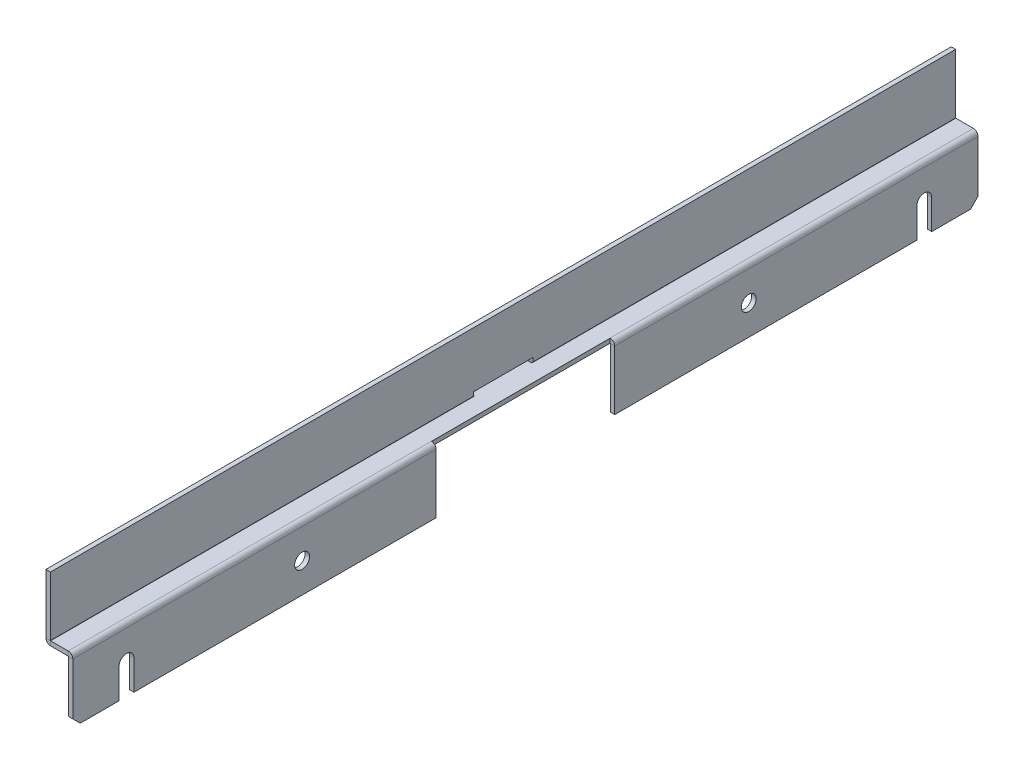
ISO-10303-21;
HEADER;
FILE_DESCRIPTION(('STEP AP214'),'2;1');
FILE_NAME('part.step','',(''),(''),'','','');
FILE_SCHEMA(('AUTOMOTIVE_DESIGN { 1 0 10303 214 1 1 1 1 }'));
ENDSEC;
DATA;
#1=APPLICATION_CONTEXT('core data for automotive mechanical design processes');
#2=APPLICATION_PROTOCOL_DEFINITION('international standard','automotive_design',2000,#1);
#3=PRODUCT_CONTEXT('',#1,'mechanical');
#4=PRODUCT('Part','Part','',(#3));
#5=PRODUCT_RELATED_PRODUCT_CATEGORY('part','',(#4));
#6=PRODUCT_DEFINITION_FORMATION('','',#4);
#7=PRODUCT_DEFINITION_CONTEXT('part definition',#1,'design');
#8=PRODUCT_DEFINITION('design','',#6,#7);
#9=PRODUCT_DEFINITION_SHAPE('','',#8);
#10=(LENGTH_UNIT() NAMED_UNIT(*) SI_UNIT(.MILLI.,.METRE.));
#11=(NAMED_UNIT(*) PLANE_ANGLE_UNIT() SI_UNIT($,.RADIAN.));
#12=(NAMED_UNIT(*) SI_UNIT($,.STERADIAN.) SOLID_ANGLE_UNIT());
#13=UNCERTAINTY_MEASURE_WITH_UNIT(LENGTH_MEASURE(1.E-05),#10,'distance_accuracy_value','');
#14=(GEOMETRIC_REPRESENTATION_CONTEXT(3) GLOBAL_UNCERTAINTY_ASSIGNED_CONTEXT((#13)) GLOBAL_UNIT_ASSIGNED_CONTEXT((#10,
#11,#12)) REPRESENTATION_CONTEXT('',''));
#15=CARTESIAN_POINT('',(0.,0.,0.));
#16=DIRECTION('',(0.,0.,1.));
#17=DIRECTION('',(1.,0.,0.));
#18=AXIS2_PLACEMENT_3D('',#15,#16,#17);
#19=CARTESIAN_POINT('',(0.10000000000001,-43.001,20.));
#20=DIRECTION('',(1.,0.,0.));
#21=DIRECTION('',(0.,0.,-1.));
#22=AXIS2_PLACEMENT_3D('',#19,#20,#21);
#23=PLANE('',#22);
#24=DIRECTION('',(0.,0.,1.));
#25=VECTOR('',#24,1.);
#26=CARTESIAN_POINT('',(0.10000000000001,-43.,20.));
#27=LINE('',#26,#25);
#28=CARTESIAN_POINT('',(0.10000000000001,-43.,-20.));
#29=VERTEX_POINT('',#28);
#30=CARTESIAN_POINT('',(0.100000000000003,-43.,-19.2));
#31=VERTEX_POINT('',#30);
#32=EDGE_CURVE('E606',#29,#31,#27,.T.);
#33=ORIENTED_EDGE('',*,*,#32,.T.);
#34=DIRECTION('',(0.,-1.,0.));
#35=VECTOR('',#34,1.);
#36=CARTESIAN_POINT('',(0.100000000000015,-40.,-19.2));
#37=LINE('',#36,#35);
#38=CARTESIAN_POINT('',(0.100000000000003,-40.,-19.2));
#39=VERTEX_POINT('',#38);
#40=EDGE_CURVE('E72',#39,#31,#37,.T.);
#41=ORIENTED_EDGE('',*,*,#40,.F.);
#42=DIRECTION('',(0.,0.,-1.));
#43=VECTOR('',#42,1.);
#44=CARTESIAN_POINT('',(0.10000000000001,-40.,20.));
#45=LINE('',#44,#43);
#46=CARTESIAN_POINT('',(0.100000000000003,-40.,-20.));
#47=VERTEX_POINT('',#46);
#48=EDGE_CURVE('E603',#39,#47,#45,.T.);
#49=ORIENTED_EDGE('',*,*,#48,.T.);
#50=DIRECTION('',(0.,1.,0.));
#51=VECTOR('',#50,1.);
#52=CARTESIAN_POINT('',(0.100000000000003,-43.001,-20.));
#53=LINE('',#52,#51);
#54=EDGE_CURVE('E13',#29,#47,#53,.T.);
#55=ORIENTED_EDGE('',*,*,#54,.F.);
#56=EDGE_LOOP('',(#33,#41,#49,#55));
#57=FACE_BOUND('',#56,.T.);
#58=ADVANCED_FACE('F57',(#57),#23,.F.);
#59=CARTESIAN_POINT('',(11.9,-43.1,-304.));
#60=DIRECTION('',(0.,0.,1.));
#61=DIRECTION('',(1.,0.,0.));
#62=AXIS2_PLACEMENT_3D('',#59,#60,#61);
#63=PLANE('',#62);
#64=DIRECTION('',(0.,1.,0.));
#65=VECTOR('',#64,1.);
#66=CARTESIAN_POINT('',(11.9,-43.,-304.));
#67=LINE('',#66,#65);
#68=CARTESIAN_POINT('',(11.9,-43.,-304.));
#69=VERTEX_POINT('',#68);
#70=CARTESIAN_POINT('',(11.9,-40.,-304.));
#71=VERTEX_POINT('',#70);
#72=EDGE_CURVE('E625',#69,#71,#67,.T.);
#73=ORIENTED_EDGE('',*,*,#72,.F.);
#74=DIRECTION('',(1.,0.,0.));
#75=VECTOR('',#74,1.);
#76=CARTESIAN_POINT('',(0.,-43.,-304.));
#77=LINE('',#76,#75);
#78=CARTESIAN_POINT('',(0.10000000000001,-43.,-304.));
#79=VERTEX_POINT('',#78);
#80=EDGE_CURVE('E612',#79,#69,#77,.T.);
#81=ORIENTED_EDGE('',*,*,#80,.F.);
#82=DIRECTION('',(0.,-1.,0.));
#83=VECTOR('',#82,1.);
#84=CARTESIAN_POINT('',(0.10000000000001,-40.,-304.));
#85=LINE('',#84,#83);
#86=CARTESIAN_POINT('',(0.100000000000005,-40.,-304.));
#87=VERTEX_POINT('',#86);
#88=EDGE_CURVE('E642',#87,#79,#85,.T.);
#89=ORIENTED_EDGE('',*,*,#88,.F.);
#90=DIRECTION('',(1.,0.,0.));
#91=VECTOR('',#90,1.);
#92=CARTESIAN_POINT('',(0.,-40.,-304.));
#93=LINE('',#92,#91);
#94=EDGE_CURVE('E608',#87,#71,#93,.T.);
#95=ORIENTED_EDGE('',*,*,#94,.T.);
#96=EDGE_LOOP('',(#73,#81,#89,#95));
#97=FACE_BOUND('',#96,.T.);
#98=ADVANCED_FACE('F730',(#97),#63,.F.);
#99=CARTESIAN_POINT('',(11.9,-43.1,304.));
#100=DIRECTION('',(0.,0.,1.));
#101=DIRECTION('',(1.,0.,0.));
#102=AXIS2_PLACEMENT_3D('',#99,#100,#101);
#103=PLANE('',#102);
#104=DIRECTION('',(0.,-1.,0.));
#105=VECTOR('',#104,1.);
#106=CARTESIAN_POINT('',(11.9,-40.,304.));
#107=LINE('',#106,#105);
#108=CARTESIAN_POINT('',(11.9,-40.,304.));
#109=VERTEX_POINT('',#108);
#110=CARTESIAN_POINT('',(11.9,-43.,304.));
#111=VERTEX_POINT('',#110);
#112=EDGE_CURVE('E619',#109,#111,#107,.T.);
#113=ORIENTED_EDGE('',*,*,#112,.F.);
#114=DIRECTION('',(1.,0.,0.));
#115=VECTOR('',#114,1.);
#116=CARTESIAN_POINT('',(0.,-40.,304.));
#117=LINE('',#116,#115);
#118=CARTESIAN_POINT('',(0.100000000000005,-40.,304.));
#119=VERTEX_POINT('',#118);
#120=EDGE_CURVE('E609',#119,#109,#117,.T.);
#121=ORIENTED_EDGE('',*,*,#120,.F.);
#122=DIRECTION('',(0.,1.,0.));
#123=VECTOR('',#122,1.);
#124=CARTESIAN_POINT('',(0.10000000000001,-43.,304.));
#125=LINE('',#124,#123);
#126=CARTESIAN_POINT('',(0.10000000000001,-43.,304.));
#127=VERTEX_POINT('',#126);
#128=EDGE_CURVE('E636',#127,#119,#125,.T.);
#129=ORIENTED_EDGE('',*,*,#128,.F.);
#130=DIRECTION('',(1.,0.,0.));
#131=VECTOR('',#130,1.);
#132=CARTESIAN_POINT('',(0.,-43.,304.));
#133=LINE('',#132,#131);
#134=EDGE_CURVE('E611',#127,#111,#133,.T.);
#135=ORIENTED_EDGE('',*,*,#134,.T.);
#136=EDGE_LOOP('',(#113,#121,#129,#135));
#137=FACE_BOUND('',#136,.T.);
#138=ADVANCED_FACE('F59',(#137),#103,.T.);
#139=CARTESIAN_POINT('',(0.,-40.,304.));
#140=DIRECTION('',(0.,1.,0.));
#141=DIRECTION('',(0.,0.,1.));
#142=AXIS2_PLACEMENT_3D('',#139,#140,#141);
#143=PLANE('',#142);
#144=ORIENTED_EDGE('',*,*,#94,.F.);
#145=DIRECTION('',(0.,0.,-1.));
#146=VECTOR('',#145,1.);
#147=CARTESIAN_POINT('',(0.10000000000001,-40.,304.));
#148=LINE('',#147,#146);
#149=EDGE_CURVE('E639',#47,#87,#148,.T.);
#150=ORIENTED_EDGE('',*,*,#149,.F.);
#151=ORIENTED_EDGE('',*,*,#48,.F.);
#152=DIRECTION('',(1.,0.,0.));
#153=VECTOR('',#152,1.);
#154=CARTESIAN_POINT('',(0.100000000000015,-40.,-19.2));
#155=LINE('',#154,#153);
#156=CARTESIAN_POINT('',(-2.89999999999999,-40.,-19.2));
#157=VERTEX_POINT('',#156);
#158=EDGE_CURVE('E323',#157,#39,#155,.T.);
#159=ORIENTED_EDGE('',*,*,#158,.F.);
#160=DIRECTION('',(0.,0.,-1.));
#161=VECTOR('',#160,1.);
#162=CARTESIAN_POINT('',(-2.89999999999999,-40.,19.2));
#163=LINE('',#162,#161);
#164=CARTESIAN_POINT('',(-2.89999999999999,-40.,19.2));
#165=VERTEX_POINT('',#164);
#166=EDGE_CURVE('E306',#165,#157,#163,.T.);
#167=ORIENTED_EDGE('',*,*,#166,.F.);
#168=DIRECTION('',(-1.,0.,0.));
#169=VECTOR('',#168,1.);
#170=CARTESIAN_POINT('',(0.10000000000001,-40.,19.2));
#171=LINE('',#170,#169);
#172=CARTESIAN_POINT('',(0.10000000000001,-40.,19.2));
#173=VERTEX_POINT('',#172);
#174=EDGE_CURVE('E321',#173,#165,#171,.T.);
#175=ORIENTED_EDGE('',*,*,#174,.F.);
#176=CARTESIAN_POINT('',(0.10000000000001,-40.,20.));
#177=VERTEX_POINT('',#176);
#178=EDGE_CURVE('E80',#177,#173,#45,.T.);
#179=ORIENTED_EDGE('',*,*,#178,.F.);
#180=DIRECTION('',(0.,0.,-1.));
#181=VECTOR('',#180,1.);
#182=CARTESIAN_POINT('',(0.10000000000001,-40.,304.));
#183=LINE('',#182,#181);
#184=EDGE_CURVE('E628',#119,#177,#183,.T.);
#185=ORIENTED_EDGE('',*,*,#184,.F.);
#186=ORIENTED_EDGE('',*,*,#120,.T.);
#187=DIRECTION('',(0.,0.,-1.));
#188=VECTOR('',#187,1.);
#189=CARTESIAN_POINT('',(11.9,-40.,304.));
#190=LINE('',#189,#188);
#191=EDGE_CURVE('E614',#109,#71,#190,.T.);
#192=ORIENTED_EDGE('',*,*,#191,.T.);
#193=EDGE_LOOP('',(#144,#150,#151,#159,#167,#175,#179,#185,#186,#192));
#194=FACE_BOUND('',#193,.T.);
#195=ADVANCED_FACE('F320',(#194),#143,.T.);
#196=CARTESIAN_POINT('',(0.,-43.,304.));
#197=DIRECTION('',(0.,1.,0.));
#198=DIRECTION('',(0.,0.,1.));
#199=AXIS2_PLACEMENT_3D('',#196,#197,#198);
#200=PLANE('',#199);
#201=ORIENTED_EDGE('',*,*,#80,.T.);
#202=DIRECTION('',(0.,0.,-1.));
#203=VECTOR('',#202,1.);
#204=CARTESIAN_POINT('',(11.9,-43.,304.));
#205=LINE('',#204,#203);
#206=EDGE_CURVE('E622',#111,#69,#205,.T.);
#207=ORIENTED_EDGE('',*,*,#206,.F.);
#208=ORIENTED_EDGE('',*,*,#134,.F.);
#209=DIRECTION('',(0.,0.,-1.));
#210=VECTOR('',#209,1.);
#211=CARTESIAN_POINT('',(0.10000000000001,-43.,304.));
#212=LINE('',#211,#210);
#213=CARTESIAN_POINT('',(0.10000000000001,-43.,20.));
#214=VERTEX_POINT('',#213);
#215=EDGE_CURVE('E633',#127,#214,#212,.T.);
#216=ORIENTED_EDGE('',*,*,#215,.T.);
#217=CARTESIAN_POINT('',(0.10000000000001,-43.,19.2));
#218=VERTEX_POINT('',#217);
#219=EDGE_CURVE('E605',#218,#214,#27,.T.);
#220=ORIENTED_EDGE('',*,*,#219,.F.);
#221=DIRECTION('',(-1.,0.,0.));
#222=VECTOR('',#221,1.);
#223=CARTESIAN_POINT('',(0.10000000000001,-43.,19.2));
#224=LINE('',#223,#222);
#225=CARTESIAN_POINT('',(-2.89999999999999,-43.,19.2));
#226=VERTEX_POINT('',#225);
#227=EDGE_CURVE('E332',#218,#226,#224,.T.);
#228=ORIENTED_EDGE('',*,*,#227,.T.);
#229=DIRECTION('',(0.,0.,-1.));
#230=VECTOR('',#229,1.);
#231=CARTESIAN_POINT('',(-2.89999999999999,-43.,19.2));
#232=LINE('',#231,#230);
#233=CARTESIAN_POINT('',(-2.89999999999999,-43.,-19.2));
#234=VERTEX_POINT('',#233);
#235=EDGE_CURVE('E309',#226,#234,#232,.T.);
#236=ORIENTED_EDGE('',*,*,#235,.T.);
#237=DIRECTION('',(1.,0.,0.));
#238=VECTOR('',#237,1.);
#239=CARTESIAN_POINT('',(0.100000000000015,-43.,-19.2));
#240=LINE('',#239,#238);
#241=EDGE_CURVE('E326',#234,#31,#240,.T.);
#242=ORIENTED_EDGE('',*,*,#241,.T.);
#243=ORIENTED_EDGE('',*,*,#32,.F.);
#244=DIRECTION('',(0.,0.,-1.));
#245=VECTOR('',#244,1.);
#246=CARTESIAN_POINT('',(0.10000000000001,-43.,304.));
#247=LINE('',#246,#245);
#248=EDGE_CURVE('E65',#29,#79,#247,.T.);
#249=ORIENTED_EDGE('',*,*,#248,.T.);
#250=EDGE_LOOP('',(#201,#207,#208,#216,#220,#228,#236,#242,#243,#249));
#251=FACE_BOUND('',#250,.T.);
#252=ADVANCED_FACE('F647',(#251),#200,.F.);
#253=ORIENTED_EDGE('',*,*,#178,.T.);
#254=DIRECTION('',(0.,-1.,0.));
#255=VECTOR('',#254,1.);
#256=CARTESIAN_POINT('',(0.10000000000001,-40.,19.2));
#257=LINE('',#256,#255);
#258=EDGE_CURVE('E315',#173,#218,#257,.T.);
#259=ORIENTED_EDGE('',*,*,#258,.T.);
#260=ORIENTED_EDGE('',*,*,#219,.T.);
#261=DIRECTION('',(0.,1.,0.));
#262=VECTOR('',#261,1.);
#263=CARTESIAN_POINT('',(0.10000000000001,-43.001,20.));
#264=LINE('',#263,#262);
#265=EDGE_CURVE('E631',#214,#177,#264,.T.);
#266=ORIENTED_EDGE('',*,*,#265,.T.);
#267=EDGE_LOOP('',(#253,#259,#260,#266));
#268=FACE_BOUND('',#267,.T.);
#269=ADVANCED_FACE('F691',(#268),#23,.F.);
#270=CARTESIAN_POINT('',(11.9,-43.1,304.));
#271=DIRECTION('',(0.,0.,1.));
#272=DIRECTION('',(0.,1.,0.));
#273=AXIS2_PLACEMENT_3D('',#270,#271,#272);
#274=PLANE('',#273);
#275=ORIENTED_EDGE('',*,*,#112,.T.);
#276=CARTESIAN_POINT('',(11.9,-43.1,304.));
#277=DIRECTION('',(0.,0.,-1.));
#278=DIRECTION('',(0.,-1.,0.));
#279=AXIS2_PLACEMENT_3D('',#276,#277,#278);
#280=CIRCLE('',#279,0.0999999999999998);
#281=CARTESIAN_POINT('',(12.,-43.1,304.));
#282=VERTEX_POINT('',#281);
#283=EDGE_CURVE('E500',#111,#282,#280,.T.);
#284=ORIENTED_EDGE('',*,*,#283,.T.);
#285=DIRECTION('',(1.,0.,0.));
#286=VECTOR('',#285,1.);
#287=CARTESIAN_POINT('',(12.,-43.1,304.));
#288=LINE('',#287,#286);
#289=CARTESIAN_POINT('',(15.,-43.1,304.));
#290=VERTEX_POINT('',#289);
#291=EDGE_CURVE('E562',#282,#290,#288,.T.);
#292=ORIENTED_EDGE('',*,*,#291,.T.);
#293=CARTESIAN_POINT('',(11.9,-43.1,304.));
#294=DIRECTION('',(0.,0.,-1.));
#295=DIRECTION('',(0.,-1.,0.));
#296=AXIS2_PLACEMENT_3D('',#293,#294,#295);
#297=CIRCLE('',#296,3.1);
#298=EDGE_CURVE('E570',#109,#290,#297,.T.);
#299=ORIENTED_EDGE('',*,*,#298,.F.);
#300=EDGE_LOOP('',(#275,#284,#292,#299));
#301=FACE_BOUND('',#300,.T.);
#302=ADVANCED_FACE('F738',(#301),#274,.T.);
#303=CARTESIAN_POINT('',(11.9,-43.1,60.0000000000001));
#304=DIRECTION('',(0.,0.,-1.));
#305=DIRECTION('',(0.,-1.,0.));
#306=AXIS2_PLACEMENT_3D('',#303,#304,#305);
#307=PLANE('',#306);
#308=DIRECTION('',(-1.,0.,0.));
#309=VECTOR('',#308,1.);
#310=CARTESIAN_POINT('',(15.,-43.1,60.));
#311=LINE('',#310,#309);
#312=CARTESIAN_POINT('',(15.,-43.1,60.0000000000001));
#313=VERTEX_POINT('',#312);
#314=CARTESIAN_POINT('',(12.,-43.1,60.));
#315=VERTEX_POINT('',#314);
#316=EDGE_CURVE('E565',#313,#315,#311,.T.);
#317=ORIENTED_EDGE('',*,*,#316,.T.);
#318=CARTESIAN_POINT('',(11.9,-43.1,60.0000000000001));
#319=DIRECTION('',(0.,0.,-1.));
#320=DIRECTION('',(0.,-1.,0.));
#321=AXIS2_PLACEMENT_3D('',#318,#319,#320);
#322=CIRCLE('',#321,0.0999999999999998);
#323=CARTESIAN_POINT('',(11.9032258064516,-43.0000520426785,60.0000000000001));
#324=VERTEX_POINT('',#323);
#325=EDGE_CURVE('E593',#315,#324,#322,.F.);
#326=ORIENTED_EDGE('',*,*,#325,.T.);
#327=DIRECTION('',(0.0322580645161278,0.999479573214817,0.));
#328=VECTOR('',#327,1.);
#329=CARTESIAN_POINT('',(12.,-40.0016133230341,60.0000000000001));
#330=LINE('',#329,#328);
#331=CARTESIAN_POINT('',(12.,-40.0016133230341,60.0000000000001));
#332=VERTEX_POINT('',#331);
#333=EDGE_CURVE('E601',#324,#332,#330,.T.);
#334=ORIENTED_EDGE('',*,*,#333,.T.);
#335=CARTESIAN_POINT('',(11.9,-43.1,60.0000000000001));
#336=DIRECTION('',(0.,0.,1.));
#337=DIRECTION('',(0.,1.,0.));
#338=AXIS2_PLACEMENT_3D('',#335,#336,#337);
#339=CIRCLE('',#338,3.1);
#340=EDGE_CURVE('E573',#313,#332,#339,.T.);
#341=ORIENTED_EDGE('',*,*,#340,.F.);
#342=EDGE_LOOP('',(#317,#326,#334,#341));
#343=FACE_BOUND('',#342,.T.);
#344=ADVANCED_FACE('F743',(#343),#307,.T.);
#345=CARTESIAN_POINT('',(12.,-40.0016133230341,0.));
#346=DIRECTION('',(0.999479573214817,-0.0322580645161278,0.));
#347=DIRECTION('',(0.,0.,-1.));
#348=AXIS2_PLACEMENT_3D('',#345,#346,#347);
#349=PLANE('',#348);
#350=ORIENTED_EDGE('',*,*,#333,.F.);
#351=DIRECTION('',(0.,0.,-1.));
#352=VECTOR('',#351,1.);
#353=CARTESIAN_POINT('',(11.9032258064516,-43.0000520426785,608.008585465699));
#354=LINE('',#353,#352);
#355=CARTESIAN_POINT('',(11.9032258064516,-43.0000520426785,-60.0000000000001));
#356=VERTEX_POINT('',#355);
#357=EDGE_CURVE('E590',#324,#356,#354,.T.);
#358=ORIENTED_EDGE('',*,*,#357,.T.);
#359=DIRECTION('',(0.0322580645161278,0.999479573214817,0.));
#360=VECTOR('',#359,1.);
#361=CARTESIAN_POINT('',(12.,-40.0016133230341,-60.0000000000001));
#362=LINE('',#361,#360);
#363=CARTESIAN_POINT('',(12.,-40.0016133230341,-60.0000000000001));
#364=VERTEX_POINT('',#363);
#365=EDGE_CURVE('E586',#356,#364,#362,.T.);
#366=ORIENTED_EDGE('',*,*,#365,.T.);
#367=DIRECTION('',(0.,0.,-1.));
#368=VECTOR('',#367,1.);
#369=CARTESIAN_POINT('',(12.,-40.0016133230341,59.9999999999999));
#370=LINE('',#369,#368);
#371=EDGE_CURVE('E577',#332,#364,#370,.T.);
#372=ORIENTED_EDGE('',*,*,#371,.F.);
#373=EDGE_LOOP('',(#350,#358,#366,#372));
#374=FACE_BOUND('',#373,.T.);
#375=ADVANCED_FACE('F791',(#374),#349,.T.);
#376=CARTESIAN_POINT('',(11.9,-43.1,-60.0000000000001));
#377=DIRECTION('',(0.,0.,1.));
#378=DIRECTION('',(0.,1.,0.));
#379=AXIS2_PLACEMENT_3D('',#376,#377,#378);
#380=PLANE('',#379);
#381=ORIENTED_EDGE('',*,*,#365,.F.);
#382=CARTESIAN_POINT('',(11.9,-43.1,-60.0000000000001));
#383=DIRECTION('',(0.,0.,-1.));
#384=DIRECTION('',(0.,-1.,0.));
#385=AXIS2_PLACEMENT_3D('',#382,#383,#384);
#386=CIRCLE('',#385,0.0999999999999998);
#387=CARTESIAN_POINT('',(12.,-43.1,-60.));
#388=VERTEX_POINT('',#387);
#389=EDGE_CURVE('E587',#356,#388,#386,.T.);
#390=ORIENTED_EDGE('',*,*,#389,.T.);
#391=DIRECTION('',(-1.,0.,0.));
#392=VECTOR('',#391,1.);
#393=CARTESIAN_POINT('',(15.,-43.1,-60.));
#394=LINE('',#393,#392);
#395=CARTESIAN_POINT('',(15.,-43.1,-60.));
#396=VERTEX_POINT('',#395);
#397=EDGE_CURVE('E442',#396,#388,#394,.T.);
#398=ORIENTED_EDGE('',*,*,#397,.F.);
#399=CARTESIAN_POINT('',(11.9,-43.1,-60.0000000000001));
#400=DIRECTION('',(0.,0.,-1.));
#401=DIRECTION('',(0.,-1.,0.));
#402=AXIS2_PLACEMENT_3D('',#399,#400,#401);
#403=CIRCLE('',#402,3.1);
#404=EDGE_CURVE('E580',#364,#396,#403,.T.);
#405=ORIENTED_EDGE('',*,*,#404,.F.);
#406=EDGE_LOOP('',(#381,#390,#398,#405));
#407=FACE_BOUND('',#406,.T.);
#408=ADVANCED_FACE('F802',(#407),#380,.T.);
#409=CARTESIAN_POINT('',(11.9,-43.1,-304.));
#410=DIRECTION('',(0.,0.,-1.));
#411=DIRECTION('',(0.,-1.,0.));
#412=AXIS2_PLACEMENT_3D('',#409,#410,#411);
#413=PLANE('',#412);
#414=CARTESIAN_POINT('',(11.9,-43.1,-304.));
#415=DIRECTION('',(0.,0.,-1.));
#416=DIRECTION('',(0.,-1.,0.));
#417=AXIS2_PLACEMENT_3D('',#414,#415,#416);
#418=CIRCLE('',#417,0.0999999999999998);
#419=CARTESIAN_POINT('',(12.,-43.1,-304.));
#420=VERTEX_POINT('',#419);
#421=EDGE_CURVE('E574',#420,#69,#418,.F.);
#422=ORIENTED_EDGE('',*,*,#421,.T.);
#423=ORIENTED_EDGE('',*,*,#72,.T.);
#424=CARTESIAN_POINT('',(11.9,-43.1,-304.));
#425=DIRECTION('',(0.,0.,1.));
#426=DIRECTION('',(0.,1.,0.));
#427=AXIS2_PLACEMENT_3D('',#424,#425,#426);
#428=CIRCLE('',#427,3.1);
#429=CARTESIAN_POINT('',(15.,-43.1,-304.));
#430=VERTEX_POINT('',#429);
#431=EDGE_CURVE('E583',#430,#71,#428,.T.);
#432=ORIENTED_EDGE('',*,*,#431,.F.);
#433=DIRECTION('',(-1.,0.,0.));
#434=VECTOR('',#433,1.);
#435=CARTESIAN_POINT('',(15.,-43.1,-304.));
#436=LINE('',#435,#434);
#437=EDGE_CURVE('E493',#430,#420,#436,.T.);
#438=ORIENTED_EDGE('',*,*,#437,.T.);
#439=EDGE_LOOP('',(#422,#423,#432,#438));
#440=FACE_BOUND('',#439,.T.);
#441=ADVANCED_FACE('F813',(#440),#413,.T.);
#442=CARTESIAN_POINT('',(11.9,-43.1,608.008585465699));
#443=DIRECTION('',(0.,0.,-1.));
#444=DIRECTION('',(0.,-1.,0.));
#445=AXIS2_PLACEMENT_3D('',#442,#443,#444);
#446=CYLINDRICAL_SURFACE('',#445,3.1);
#447=DIRECTION('',(0.,0.,-1.));
#448=VECTOR('',#447,1.);
#449=CARTESIAN_POINT('',(15.,-43.1,304.));
#450=LINE('',#449,#448);
#451=EDGE_CURVE('E365',#396,#430,#450,.T.);
#452=ORIENTED_EDGE('',*,*,#451,.T.);
#453=ORIENTED_EDGE('',*,*,#431,.T.);
#454=ORIENTED_EDGE('',*,*,#191,.F.);
#455=ORIENTED_EDGE('',*,*,#298,.T.);
#456=DIRECTION('',(0.,0.,-1.));
#457=VECTOR('',#456,1.);
#458=CARTESIAN_POINT('',(15.,-43.1,304.));
#459=LINE('',#458,#457);
#460=EDGE_CURVE('E428',#290,#313,#459,.T.);
#461=ORIENTED_EDGE('',*,*,#460,.T.);
#462=ORIENTED_EDGE('',*,*,#340,.T.);
#463=ORIENTED_EDGE('',*,*,#371,.T.);
#464=ORIENTED_EDGE('',*,*,#404,.T.);
#465=EDGE_LOOP('',(#452,#453,#454,#455,#461,#462,#463,#464));
#466=FACE_BOUND('',#465,.T.);
#467=ADVANCED_FACE('F824',(#466),#446,.T.);
#468=CARTESIAN_POINT('',(11.9,-43.1,608.008585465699));
#469=DIRECTION('',(0.,0.,-1.));
#470=DIRECTION('',(0.,-1.,0.));
#471=AXIS2_PLACEMENT_3D('',#468,#469,#470);
#472=CYLINDRICAL_SURFACE('',#471,0.0999999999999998);
#473=DIRECTION('',(0.,0.,-1.));
#474=VECTOR('',#473,1.);
#475=CARTESIAN_POINT('',(12.,-43.1,304.));
#476=LINE('',#475,#474);
#477=EDGE_CURVE('E437',#388,#420,#476,.T.);
#478=ORIENTED_EDGE('',*,*,#477,.F.);
#479=ORIENTED_EDGE('',*,*,#389,.F.);
#480=ORIENTED_EDGE('',*,*,#357,.F.);
#481=ORIENTED_EDGE('',*,*,#325,.F.);
#482=DIRECTION('',(0.,0.,-1.));
#483=VECTOR('',#482,1.);
#484=CARTESIAN_POINT('',(12.,-43.1,304.));
#485=LINE('',#484,#483);
#486=EDGE_CURVE('E503',#282,#315,#485,.T.);
#487=ORIENTED_EDGE('',*,*,#486,.F.);
#488=ORIENTED_EDGE('',*,*,#283,.F.);
#489=ORIENTED_EDGE('',*,*,#206,.T.);
#490=ORIENTED_EDGE('',*,*,#421,.F.);
#491=EDGE_LOOP('',(#478,#479,#480,#481,#487,#488,#489,#490));
#492=FACE_BOUND('',#491,.T.);
#493=ADVANCED_FACE('F835',(#492),#472,.F.);
#494=CARTESIAN_POINT('',(-3.00099999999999,-83.,262.929));
#495=DIRECTION('',(0.,0.,-1.));
#496=DIRECTION('',(0.,1.,0.));
#497=AXIS2_PLACEMENT_3D('',#494,#495,#496);
#498=PLANE('',#497);
#499=DIRECTION('',(0.,-1.,0.));
#500=VECTOR('',#499,1.);
#501=CARTESIAN_POINT('',(12.,-83.,262.929));
#502=LINE('',#501,#500);
#503=CARTESIAN_POINT('',(12.,-63.,262.929));
#504=VERTEX_POINT('',#503);
#505=CARTESIAN_POINT('',(12.,-83.,262.929));
#506=VERTEX_POINT('',#505);
#507=EDGE_CURVE('E560',#504,#506,#502,.T.);
#508=ORIENTED_EDGE('',*,*,#507,.T.);
#509=DIRECTION('',(1.,0.,0.));
#510=VECTOR('',#509,1.);
#511=CARTESIAN_POINT('',(-3.00099999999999,-83.,262.929));
#512=LINE('',#511,#510);
#513=CARTESIAN_POINT('',(15.,-83.,262.929));
#514=VERTEX_POINT('',#513);
#515=EDGE_CURVE('E558',#506,#514,#512,.T.);
#516=ORIENTED_EDGE('',*,*,#515,.T.);
#517=DIRECTION('',(0.,1.,0.));
#518=VECTOR('',#517,1.);
#519=CARTESIAN_POINT('',(15.,-83.,262.929));
#520=LINE('',#519,#518);
#521=CARTESIAN_POINT('',(15.,-63.,262.929));
#522=VERTEX_POINT('',#521);
#523=EDGE_CURVE('E555',#514,#522,#520,.T.);
#524=ORIENTED_EDGE('',*,*,#523,.T.);
#525=DIRECTION('',(1.,0.,0.));
#526=VECTOR('',#525,1.);
#527=CARTESIAN_POINT('',(-3.001,-63.,262.929));
#528=LINE('',#527,#526);
#529=EDGE_CURVE('E550',#504,#522,#528,.T.);
#530=ORIENTED_EDGE('',*,*,#529,.F.);
#531=EDGE_LOOP('',(#508,#516,#524,#530));
#532=FACE_BOUND('',#531,.T.);
#533=ADVANCED_FACE('F847',(#532),#498,.F.);
#534=CARTESIAN_POINT('',(-3.001,-63.,267.929));
#535=DIRECTION('',(1.,0.,0.));
#536=DIRECTION('',(0.,1.,0.));
#537=AXIS2_PLACEMENT_3D('',#534,#535,#536);
#538=CYLINDRICAL_SURFACE('',#537,5.);
#539=CARTESIAN_POINT('',(12.,-63.,267.929));
#540=DIRECTION('',(1.,0.,0.));
#541=DIRECTION('',(0.,1.,0.));
#542=AXIS2_PLACEMENT_3D('',#539,#540,#541);
#543=CIRCLE('',#542,5.);
#544=CARTESIAN_POINT('',(12.,-63.,272.929));
#545=VERTEX_POINT('',#544);
#546=EDGE_CURVE('E552',#545,#504,#543,.F.);
#547=ORIENTED_EDGE('',*,*,#546,.T.);
#548=ORIENTED_EDGE('',*,*,#529,.T.);
#549=CARTESIAN_POINT('',(15.,-63.,267.929));
#550=DIRECTION('',(1.,0.,0.));
#551=DIRECTION('',(0.,1.,0.));
#552=AXIS2_PLACEMENT_3D('',#549,#550,#551);
#553=CIRCLE('',#552,5.);
#554=CARTESIAN_POINT('',(15.,-63.,272.929));
#555=VERTEX_POINT('',#554);
#556=EDGE_CURVE('E547',#522,#555,#553,.T.);
#557=ORIENTED_EDGE('',*,*,#556,.T.);
#558=DIRECTION('',(1.,0.,0.));
#559=VECTOR('',#558,1.);
#560=CARTESIAN_POINT('',(-3.001,-63.,272.929));
#561=LINE('',#560,#559);
#562=EDGE_CURVE('E542',#545,#555,#561,.T.);
#563=ORIENTED_EDGE('',*,*,#562,.F.);
#564=EDGE_LOOP('',(#547,#548,#557,#563));
#565=FACE_BOUND('',#564,.T.);
#566=ADVANCED_FACE('F858',(#565),#538,.F.);
#567=CARTESIAN_POINT('',(-3.00099999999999,-83.,272.929));
#568=DIRECTION('',(0.,0.,1.));
#569=DIRECTION('',(0.,-1.,0.));
#570=AXIS2_PLACEMENT_3D('',#567,#568,#569);
#571=PLANE('',#570);
#572=DIRECTION('',(0.,1.,0.));
#573=VECTOR('',#572,1.);
#574=CARTESIAN_POINT('',(12.,-83.,272.929));
#575=LINE('',#574,#573);
#576=CARTESIAN_POINT('',(12.,-83.,272.929));
#577=VERTEX_POINT('',#576);
#578=EDGE_CURVE('E544',#577,#545,#575,.T.);
#579=ORIENTED_EDGE('',*,*,#578,.T.);
#580=ORIENTED_EDGE('',*,*,#562,.T.);
#581=DIRECTION('',(0.,-1.,0.));
#582=VECTOR('',#581,1.);
#583=CARTESIAN_POINT('',(15.,-83.,272.929));
#584=LINE('',#583,#582);
#585=CARTESIAN_POINT('',(15.,-83.,272.929));
#586=VERTEX_POINT('',#585);
#587=EDGE_CURVE('E539',#555,#586,#584,.T.);
#588=ORIENTED_EDGE('',*,*,#587,.T.);
#589=DIRECTION('',(1.,0.,0.));
#590=VECTOR('',#589,1.);
#591=CARTESIAN_POINT('',(-3.00099999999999,-83.,272.929));
#592=LINE('',#591,#590);
#593=EDGE_CURVE('E533',#577,#586,#592,.T.);
#594=ORIENTED_EDGE('',*,*,#593,.F.);
#595=EDGE_LOOP('',(#579,#580,#588,#594));
#596=FACE_BOUND('',#595,.T.);
#597=ADVANCED_FACE('F868',(#596),#571,.F.);
#598=CARTESIAN_POINT('',(15.,-83.,304.));
#599=DIRECTION('',(0.,-1.,0.));
#600=DIRECTION('',(0.,0.,-1.));
#601=AXIS2_PLACEMENT_3D('',#598,#599,#600);
#602=PLANE('',#601);
#603=DIRECTION('',(0.,0.,-1.));
#604=VECTOR('',#603,1.);
#605=CARTESIAN_POINT('',(15.,-83.,304.));
#606=LINE('',#605,#604);
#607=CARTESIAN_POINT('',(15.,-83.,299.));
#608=VERTEX_POINT('',#607);
#609=EDGE_CURVE('E513',#608,#586,#606,.T.);
#610=ORIENTED_EDGE('',*,*,#609,.F.);
#611=DIRECTION('',(-1.,0.,0.));
#612=VECTOR('',#611,1.);
#613=CARTESIAN_POINT('',(15.,-83.,299.));
#614=LINE('',#613,#612);
#615=CARTESIAN_POINT('',(12.,-83.,299.));
#616=VERTEX_POINT('',#615);
#617=EDGE_CURVE('E534',#608,#616,#614,.T.);
#618=ORIENTED_EDGE('',*,*,#617,.T.);
#619=DIRECTION('',(0.,0.,-1.));
#620=VECTOR('',#619,1.);
#621=CARTESIAN_POINT('',(12.,-83.,304.));
#622=LINE('',#621,#620);
#623=EDGE_CURVE('E531',#616,#577,#622,.T.);
#624=ORIENTED_EDGE('',*,*,#623,.T.);
#625=ORIENTED_EDGE('',*,*,#593,.T.);
#626=EDGE_LOOP('',(#610,#618,#624,#625));
#627=FACE_BOUND('',#626,.T.);
#628=ADVANCED_FACE('F878',(#627),#602,.T.);
#629=CARTESIAN_POINT('',(15.,-83.,299.));
#630=DIRECTION('',(0.,0.707106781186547,-0.707106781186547));
#631=DIRECTION('',(0.,0.707106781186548,0.707106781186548));
#632=AXIS2_PLACEMENT_3D('',#629,#630,#631);
#633=PLANE('',#632);
#634=DIRECTION('',(0.,0.707106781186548,0.707106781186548));
#635=VECTOR('',#634,1.);
#636=CARTESIAN_POINT('',(15.,-59.,323.));
#637=LINE('',#636,#635);
#638=CARTESIAN_POINT('',(15.,-78.,304.));
#639=VERTEX_POINT('',#638);
#640=EDGE_CURVE('E515',#639,#608,#637,.F.);
#641=ORIENTED_EDGE('',*,*,#640,.F.);
#642=DIRECTION('',(1.,0.,0.));
#643=VECTOR('',#642,1.);
#644=CARTESIAN_POINT('',(11.9,-78.,304.));
#645=LINE('',#644,#643);
#646=CARTESIAN_POINT('',(12.,-78.,304.));
#647=VERTEX_POINT('',#646);
#648=EDGE_CURVE('E508',#647,#639,#645,.T.);
#649=ORIENTED_EDGE('',*,*,#648,.F.);
#650=DIRECTION('',(0.,-0.707106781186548,-0.707106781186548));
#651=VECTOR('',#650,1.);
#652=CARTESIAN_POINT('',(12.,-83.,299.));
#653=LINE('',#652,#651);
#654=EDGE_CURVE('E506',#616,#647,#653,.F.);
#655=ORIENTED_EDGE('',*,*,#654,.F.);
#656=ORIENTED_EDGE('',*,*,#617,.F.);
#657=EDGE_LOOP('',(#641,#649,#655,#656));
#658=FACE_BOUND('',#657,.T.);
#659=ADVANCED_FACE('F888',(#658),#633,.F.);
#660=CARTESIAN_POINT('',(12.,-83.,60.));
#661=VERTEX_POINT('',#660);
#662=EDGE_CURVE('E530',#506,#661,#622,.T.);
#663=ORIENTED_EDGE('',*,*,#662,.T.);
#664=DIRECTION('',(1.,0.,0.));
#665=VECTOR('',#664,1.);
#666=CARTESIAN_POINT('',(15.,-83.,60.));
#667=LINE('',#666,#665);
#668=CARTESIAN_POINT('',(15.,-83.,60.));
#669=VERTEX_POINT('',#668);
#670=EDGE_CURVE('E501',#669,#661,#667,.F.);
#671=ORIENTED_EDGE('',*,*,#670,.F.);
#672=EDGE_CURVE('E516',#514,#669,#606,.T.);
#673=ORIENTED_EDGE('',*,*,#672,.F.);
#674=ORIENTED_EDGE('',*,*,#515,.F.);
#675=EDGE_LOOP('',(#663,#671,#673,#674));
#676=FACE_BOUND('',#675,.T.);
#677=ADVANCED_FACE('F891',(#676),#602,.T.);
#678=CARTESIAN_POINT('',(-3.001,-62.9999999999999,150.));
#679=DIRECTION('',(1.,0.,0.));
#680=DIRECTION('',(0.,1.,0.));
#681=AXIS2_PLACEMENT_3D('',#678,#679,#680);
#682=CYLINDRICAL_SURFACE('',#681,5.00000000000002);
#683=CARTESIAN_POINT('',(15.,-62.9999999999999,150.));
#684=DIRECTION('',(1.,0.,0.));
#685=DIRECTION('',(0.,1.,0.));
#686=AXIS2_PLACEMENT_3D('',#683,#684,#685);
#687=CIRCLE('',#686,5.00000000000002);
#688=CARTESIAN_POINT('',(15.,-57.9999999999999,150.));
#689=VERTEX_POINT('',#688);
#690=EDGE_CURVE('E527',#689,#689,#687,.T.);
#691=ORIENTED_EDGE('',*,*,#690,.T.);
#692=EDGE_LOOP('',(#691));
#693=FACE_BOUND('',#692,.T.);
#694=CARTESIAN_POINT('',(12.,-62.9999999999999,150.));
#695=DIRECTION('',(1.,0.,0.));
#696=DIRECTION('',(0.,1.,0.));
#697=AXIS2_PLACEMENT_3D('',#694,#695,#696);
#698=CIRCLE('',#697,5.00000000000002);
#699=CARTESIAN_POINT('',(12.,-57.9999999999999,150.));
#700=VERTEX_POINT('',#699);
#701=EDGE_CURVE('E524',#700,#700,#698,.F.);
#702=ORIENTED_EDGE('',*,*,#701,.T.);
#703=EDGE_LOOP('',(#702));
#704=FACE_BOUND('',#703,.T.);
#705=ADVANCED_FACE('F908',(#693,#704),#682,.F.);
#706=CARTESIAN_POINT('',(15.,-40.,304.));
#707=DIRECTION('',(1.,0.,0.));
#708=DIRECTION('',(0.,1.,0.));
#709=AXIS2_PLACEMENT_3D('',#706,#707,#708);
#710=PLANE('',#709);
#711=ORIENTED_EDGE('',*,*,#690,.F.);
#712=EDGE_LOOP('',(#711));
#713=FACE_BOUND('',#712,.T.);
#714=ORIENTED_EDGE('',*,*,#672,.T.);
#715=DIRECTION('',(0.,1.,0.));
#716=VECTOR('',#715,1.);
#717=CARTESIAN_POINT('',(15.,-83.,60.));
#718=LINE('',#717,#716);
#719=EDGE_CURVE('E521',#669,#313,#718,.T.);
#720=ORIENTED_EDGE('',*,*,#719,.T.);
#721=ORIENTED_EDGE('',*,*,#460,.F.);
#722=DIRECTION('',(0.,-1.,0.));
#723=VECTOR('',#722,1.);
#724=CARTESIAN_POINT('',(15.,-40.,304.));
#725=LINE('',#724,#723);
#726=EDGE_CURVE('E518',#290,#639,#725,.T.);
#727=ORIENTED_EDGE('',*,*,#726,.T.);
#728=ORIENTED_EDGE('',*,*,#640,.T.);
#729=ORIENTED_EDGE('',*,*,#609,.T.);
#730=ORIENTED_EDGE('',*,*,#587,.F.);
#731=ORIENTED_EDGE('',*,*,#556,.F.);
#732=ORIENTED_EDGE('',*,*,#523,.F.);
#733=EDGE_LOOP('',(#714,#720,#721,#727,#728,#729,#730,#731,#732));
#734=FACE_BOUND('',#733,.T.);
#735=ADVANCED_FACE('F917',(#713,#734),#710,.T.);
#736=CARTESIAN_POINT('',(11.9,-43.1,304.));
#737=DIRECTION('',(0.,0.,1.));
#738=DIRECTION('',(1.,0.,0.));
#739=AXIS2_PLACEMENT_3D('',#736,#737,#738);
#740=PLANE('',#739);
#741=ORIENTED_EDGE('',*,*,#291,.F.);
#742=DIRECTION('',(0.,-1.,0.));
#743=VECTOR('',#742,1.);
#744=CARTESIAN_POINT('',(12.,-40.,304.));
#745=LINE('',#744,#743);
#746=EDGE_CURVE('E510',#282,#647,#745,.T.);
#747=ORIENTED_EDGE('',*,*,#746,.T.);
#748=ORIENTED_EDGE('',*,*,#648,.T.);
#749=ORIENTED_EDGE('',*,*,#726,.F.);
#750=EDGE_LOOP('',(#741,#747,#748,#749));
#751=FACE_BOUND('',#750,.T.);
#752=ADVANCED_FACE('F928',(#751),#740,.T.);
#753=CARTESIAN_POINT('',(12.,-40.,304.));
#754=DIRECTION('',(1.,0.,0.));
#755=DIRECTION('',(0.,1.,0.));
#756=AXIS2_PLACEMENT_3D('',#753,#754,#755);
#757=PLANE('',#756);
#758=ORIENTED_EDGE('',*,*,#701,.F.);
#759=EDGE_LOOP('',(#758));
#760=FACE_BOUND('',#759,.T.);
#761=DIRECTION('',(0.,1.,0.));
#762=VECTOR('',#761,1.);
#763=CARTESIAN_POINT('',(12.,-40.,60.));
#764=LINE('',#763,#762);
#765=EDGE_CURVE('E498',#661,#315,#764,.T.);
#766=ORIENTED_EDGE('',*,*,#765,.F.);
#767=ORIENTED_EDGE('',*,*,#662,.F.);
#768=ORIENTED_EDGE('',*,*,#507,.F.);
#769=ORIENTED_EDGE('',*,*,#546,.F.);
#770=ORIENTED_EDGE('',*,*,#578,.F.);
#771=ORIENTED_EDGE('',*,*,#623,.F.);
#772=ORIENTED_EDGE('',*,*,#654,.T.);
#773=ORIENTED_EDGE('',*,*,#746,.F.);
#774=ORIENTED_EDGE('',*,*,#486,.T.);
#775=EDGE_LOOP('',(#766,#767,#768,#769,#770,#771,#772,#773,#774));
#776=FACE_BOUND('',#775,.T.);
#777=ADVANCED_FACE('F940',(#760,#776),#757,.F.);
#778=CARTESIAN_POINT('',(15.,-83.,60.));
#779=DIRECTION('',(0.,0.,-1.));
#780=DIRECTION('',(0.,1.,0.));
#781=AXIS2_PLACEMENT_3D('',#778,#779,#780);
#782=PLANE('',#781);
#783=ORIENTED_EDGE('',*,*,#316,.F.);
#784=ORIENTED_EDGE('',*,*,#719,.F.);
#785=ORIENTED_EDGE('',*,*,#670,.T.);
#786=ORIENTED_EDGE('',*,*,#765,.T.);
#787=EDGE_LOOP('',(#783,#784,#785,#786));
#788=FACE_BOUND('',#787,.T.);
#789=ADVANCED_FACE('F955',(#788),#782,.T.);
#790=CARTESIAN_POINT('',(11.9,-78.,-304.));
#791=DIRECTION('',(0.,-0.707106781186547,-0.707106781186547));
#792=DIRECTION('',(0.,0.707106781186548,-0.707106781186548));
#793=AXIS2_PLACEMENT_3D('',#790,#791,#792);
#794=PLANE('',#793);
#795=DIRECTION('',(0.,0.707106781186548,-0.707106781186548));
#796=VECTOR('',#795,1.);
#797=CARTESIAN_POINT('',(15.,-363.,-19.));
#798=LINE('',#797,#796);
#799=CARTESIAN_POINT('',(15.,-83.,-299.));
#800=VERTEX_POINT('',#799);
#801=CARTESIAN_POINT('',(15.,-77.9999999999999,-304.));
#802=VERTEX_POINT('',#801);
#803=EDGE_CURVE('E445',#800,#802,#798,.T.);
#804=ORIENTED_EDGE('',*,*,#803,.F.);
#805=DIRECTION('',(1.,0.,0.));
#806=VECTOR('',#805,1.);
#807=CARTESIAN_POINT('',(15.,-83.,-299.));
#808=LINE('',#807,#806);
#809=CARTESIAN_POINT('',(12.,-83.,-299.));
#810=VERTEX_POINT('',#809);
#811=EDGE_CURVE('E491',#810,#800,#808,.T.);
#812=ORIENTED_EDGE('',*,*,#811,.F.);
#813=DIRECTION('',(0.,-0.707106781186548,0.707106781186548));
#814=VECTOR('',#813,1.);
#815=CARTESIAN_POINT('',(12.,-78.,-304.));
#816=LINE('',#815,#814);
#817=CARTESIAN_POINT('',(12.,-78.,-304.));
#818=VERTEX_POINT('',#817);
#819=EDGE_CURVE('E432',#818,#810,#816,.T.);
#820=ORIENTED_EDGE('',*,*,#819,.F.);
#821=DIRECTION('',(-1.,0.,0.));
#822=VECTOR('',#821,1.);
#823=CARTESIAN_POINT('',(12.,-78.,-304.));
#824=LINE('',#823,#822);
#825=EDGE_CURVE('E425',#802,#818,#824,.T.);
#826=ORIENTED_EDGE('',*,*,#825,.F.);
#827=EDGE_LOOP('',(#804,#812,#820,#826));
#828=FACE_BOUND('',#827,.T.);
#829=ADVANCED_FACE('F966',(#828),#794,.T.);
#830=CARTESIAN_POINT('',(15.,-83.,304.));
#831=DIRECTION('',(0.,-1.,0.));
#832=DIRECTION('',(0.,0.,-1.));
#833=AXIS2_PLACEMENT_3D('',#830,#831,#832);
#834=PLANE('',#833);
#835=DIRECTION('',(0.,0.,-1.));
#836=VECTOR('',#835,1.);
#837=CARTESIAN_POINT('',(12.,-83.,304.));
#838=LINE('',#837,#836);
#839=CARTESIAN_POINT('',(12.,-83.,-272.929));
#840=VERTEX_POINT('',#839);
#841=EDGE_CURVE('E465',#840,#810,#838,.T.);
#842=ORIENTED_EDGE('',*,*,#841,.T.);
#843=ORIENTED_EDGE('',*,*,#811,.T.);
#844=DIRECTION('',(0.,0.,-1.));
#845=VECTOR('',#844,1.);
#846=CARTESIAN_POINT('',(15.,-83.,304.));
#847=LINE('',#846,#845);
#848=CARTESIAN_POINT('',(15.,-83.,-272.929));
#849=VERTEX_POINT('',#848);
#850=EDGE_CURVE('E447',#849,#800,#847,.T.);
#851=ORIENTED_EDGE('',*,*,#850,.F.);
#852=DIRECTION('',(1.,0.,0.));
#853=VECTOR('',#852,1.);
#854=CARTESIAN_POINT('',(-3.00099999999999,-82.9999999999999,-272.929));
#855=LINE('',#854,#853);
#856=EDGE_CURVE('E487',#840,#849,#855,.T.);
#857=ORIENTED_EDGE('',*,*,#856,.F.);
#858=EDGE_LOOP('',(#842,#843,#851,#857));
#859=FACE_BOUND('',#858,.T.);
#860=ADVANCED_FACE('F977',(#859),#834,.T.);
#861=CARTESIAN_POINT('',(-3.00099999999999,-82.9999999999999,-272.929));
#862=DIRECTION('',(0.,0.,-1.));
#863=DIRECTION('',(0.,1.,0.));
#864=AXIS2_PLACEMENT_3D('',#861,#862,#863);
#865=PLANE('',#864);
#866=DIRECTION('',(0.,-1.,0.));
#867=VECTOR('',#866,1.);
#868=CARTESIAN_POINT('',(12.,-82.9999999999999,-272.929));
#869=LINE('',#868,#867);
#870=CARTESIAN_POINT('',(12.,-62.9999999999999,-272.929));
#871=VERTEX_POINT('',#870);
#872=EDGE_CURVE('E489',#871,#840,#869,.T.);
#873=ORIENTED_EDGE('',*,*,#872,.T.);
#874=ORIENTED_EDGE('',*,*,#856,.T.);
#875=DIRECTION('',(0.,1.,0.));
#876=VECTOR('',#875,1.);
#877=CARTESIAN_POINT('',(15.,-82.9999999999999,-272.929));
#878=LINE('',#877,#876);
#879=CARTESIAN_POINT('',(15.,-62.9999999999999,-272.929));
#880=VERTEX_POINT('',#879);
#881=EDGE_CURVE('E484',#849,#880,#878,.T.);
#882=ORIENTED_EDGE('',*,*,#881,.T.);
#883=DIRECTION('',(1.,0.,0.));
#884=VECTOR('',#883,1.);
#885=CARTESIAN_POINT('',(-3.001,-62.9999999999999,-272.929));
#886=LINE('',#885,#884);
#887=EDGE_CURVE('E479',#871,#880,#886,.T.);
#888=ORIENTED_EDGE('',*,*,#887,.F.);
#889=EDGE_LOOP('',(#873,#874,#882,#888));
#890=FACE_BOUND('',#889,.T.);
#891=ADVANCED_FACE('F988',(#890),#865,.F.);
#892=CARTESIAN_POINT('',(-3.001,-62.9999999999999,-267.929));
#893=DIRECTION('',(1.,0.,0.));
#894=DIRECTION('',(0.,1.,0.));
#895=AXIS2_PLACEMENT_3D('',#892,#893,#894);
#896=CYLINDRICAL_SURFACE('',#895,5.);
#897=CARTESIAN_POINT('',(12.,-62.9999999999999,-267.929));
#898=DIRECTION('',(1.,0.,0.));
#899=DIRECTION('',(0.,1.,0.));
#900=AXIS2_PLACEMENT_3D('',#897,#898,#899);
#901=CIRCLE('',#900,5.);
#902=CARTESIAN_POINT('',(12.,-62.9999999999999,-262.929));
#903=VERTEX_POINT('',#902);
#904=EDGE_CURVE('E481',#903,#871,#901,.F.);
#905=ORIENTED_EDGE('',*,*,#904,.T.);
#906=ORIENTED_EDGE('',*,*,#887,.T.);
#907=CARTESIAN_POINT('',(15.,-62.9999999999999,-267.929));
#908=DIRECTION('',(1.,0.,0.));
#909=DIRECTION('',(0.,1.,0.));
#910=AXIS2_PLACEMENT_3D('',#907,#908,#909);
#911=CIRCLE('',#910,5.);
#912=CARTESIAN_POINT('',(15.,-62.9999999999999,-262.929));
#913=VERTEX_POINT('',#912);
#914=EDGE_CURVE('E476',#880,#913,#911,.T.);
#915=ORIENTED_EDGE('',*,*,#914,.T.);
#916=DIRECTION('',(1.,0.,0.));
#917=VECTOR('',#916,1.);
#918=CARTESIAN_POINT('',(-3.001,-62.9999999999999,-262.929));
#919=LINE('',#918,#917);
#920=EDGE_CURVE('E471',#903,#913,#919,.T.);
#921=ORIENTED_EDGE('',*,*,#920,.F.);
#922=EDGE_LOOP('',(#905,#906,#915,#921));
#923=FACE_BOUND('',#922,.T.);
#924=ADVANCED_FACE('F1001',(#923),#896,.F.);
#925=CARTESIAN_POINT('',(-3.00099999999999,-82.9999999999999,-262.929));
#926=DIRECTION('',(0.,0.,1.));
#927=DIRECTION('',(0.,-1.,0.));
#928=AXIS2_PLACEMENT_3D('',#925,#926,#927);
#929=PLANE('',#928);
#930=DIRECTION('',(0.,1.,0.));
#931=VECTOR('',#930,1.);
#932=CARTESIAN_POINT('',(12.,-82.9999999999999,-262.929));
#933=LINE('',#932,#931);
#934=CARTESIAN_POINT('',(12.,-82.9999999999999,-262.929));
#935=VERTEX_POINT('',#934);
#936=EDGE_CURVE('E473',#935,#903,#933,.T.);
#937=ORIENTED_EDGE('',*,*,#936,.T.);
#938=ORIENTED_EDGE('',*,*,#920,.T.);
#939=DIRECTION('',(0.,-1.,0.));
#940=VECTOR('',#939,1.);
#941=CARTESIAN_POINT('',(15.,-82.9999999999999,-262.929));
#942=LINE('',#941,#940);
#943=CARTESIAN_POINT('',(15.,-82.9999999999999,-262.929));
#944=VERTEX_POINT('',#943);
#945=EDGE_CURVE('E468',#913,#944,#942,.T.);
#946=ORIENTED_EDGE('',*,*,#945,.T.);
#947=DIRECTION('',(1.,0.,0.));
#948=VECTOR('',#947,1.);
#949=CARTESIAN_POINT('',(-3.00099999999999,-82.9999999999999,-262.929));
#950=LINE('',#949,#948);
#951=EDGE_CURVE('E459',#935,#944,#950,.T.);
#952=ORIENTED_EDGE('',*,*,#951,.F.);
#953=EDGE_LOOP('',(#937,#938,#946,#952));
#954=FACE_BOUND('',#953,.T.);
#955=ADVANCED_FACE('F1012',(#954),#929,.F.);
#956=CARTESIAN_POINT('',(15.,-83.,-60.));
#957=VERTEX_POINT('',#956);
#958=EDGE_CURVE('E448',#957,#944,#847,.T.);
#959=ORIENTED_EDGE('',*,*,#958,.F.);
#960=DIRECTION('',(1.,0.,0.));
#961=VECTOR('',#960,1.);
#962=CARTESIAN_POINT('',(15.,-83.,-60.));
#963=LINE('',#962,#961);
#964=CARTESIAN_POINT('',(12.,-83.,-60.));
#965=VERTEX_POINT('',#964);
#966=EDGE_CURVE('E464',#957,#965,#963,.F.);
#967=ORIENTED_EDGE('',*,*,#966,.T.);
#968=EDGE_CURVE('E462',#965,#935,#838,.T.);
#969=ORIENTED_EDGE('',*,*,#968,.T.);
#970=ORIENTED_EDGE('',*,*,#951,.T.);
#971=EDGE_LOOP('',(#959,#967,#969,#970));
#972=FACE_BOUND('',#971,.T.);
#973=ADVANCED_FACE('F991',(#972),#834,.T.);
#974=CARTESIAN_POINT('',(-3.001,-62.9999999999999,-150.));
#975=DIRECTION('',(1.,0.,0.));
#976=DIRECTION('',(0.,1.,0.));
#977=AXIS2_PLACEMENT_3D('',#974,#975,#976);
#978=CYLINDRICAL_SURFACE('',#977,5.00000000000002);
#979=CARTESIAN_POINT('',(15.,-62.9999999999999,-150.));
#980=DIRECTION('',(1.,0.,0.));
#981=DIRECTION('',(0.,1.,0.));
#982=AXIS2_PLACEMENT_3D('',#979,#980,#981);
#983=CIRCLE('',#982,5.00000000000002);
#984=CARTESIAN_POINT('',(15.,-57.9999999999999,-150.));
#985=VERTEX_POINT('',#984);
#986=EDGE_CURVE('E456',#985,#985,#983,.T.);
#987=ORIENTED_EDGE('',*,*,#986,.T.);
#988=EDGE_LOOP('',(#987));
#989=FACE_BOUND('',#988,.T.);
#990=CARTESIAN_POINT('',(12.,-62.9999999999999,-150.));
#991=DIRECTION('',(1.,0.,0.));
#992=DIRECTION('',(0.,1.,0.));
#993=AXIS2_PLACEMENT_3D('',#990,#991,#992);
#994=CIRCLE('',#993,5.00000000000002);
#995=CARTESIAN_POINT('',(12.,-57.9999999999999,-150.));
#996=VERTEX_POINT('',#995);
#997=EDGE_CURVE('E453',#996,#996,#994,.F.);
#998=ORIENTED_EDGE('',*,*,#997,.T.);
#999=EDGE_LOOP('',(#998));
#1000=FACE_BOUND('',#999,.T.);
#1001=ADVANCED_FACE('F1035',(#989,#1000),#978,.F.);
#1002=CARTESIAN_POINT('',(15.,-40.,304.));
#1003=DIRECTION('',(1.,0.,0.));
#1004=DIRECTION('',(0.,1.,0.));
#1005=AXIS2_PLACEMENT_3D('',#1002,#1003,#1004);
#1006=PLANE('',#1005);
#1007=ORIENTED_EDGE('',*,*,#986,.F.);
#1008=EDGE_LOOP('',(#1007));
#1009=FACE_BOUND('',#1008,.T.);
#1010=ORIENTED_EDGE('',*,*,#451,.F.);
#1011=DIRECTION('',(0.,-1.,0.));
#1012=VECTOR('',#1011,1.);
#1013=CARTESIAN_POINT('',(15.,-83.,-60.));
#1014=LINE('',#1013,#1012);
#1015=EDGE_CURVE('E450',#396,#957,#1014,.T.);
#1016=ORIENTED_EDGE('',*,*,#1015,.T.);
#1017=ORIENTED_EDGE('',*,*,#958,.T.);
#1018=ORIENTED_EDGE('',*,*,#945,.F.);
#1019=ORIENTED_EDGE('',*,*,#914,.F.);
#1020=ORIENTED_EDGE('',*,*,#881,.F.);
#1021=ORIENTED_EDGE('',*,*,#850,.T.);
#1022=ORIENTED_EDGE('',*,*,#803,.T.);
#1023=DIRECTION('',(0.,-1.,0.));
#1024=VECTOR('',#1023,1.);
#1025=CARTESIAN_POINT('',(15.,-40.,-304.));
#1026=LINE('',#1025,#1024);
#1027=EDGE_CURVE('E429',#430,#802,#1026,.T.);
#1028=ORIENTED_EDGE('',*,*,#1027,.F.);
#1029=EDGE_LOOP('',(#1010,#1016,#1017,#1018,#1019,#1020,#1021,#1022,#1028));
#1030=FACE_BOUND('',#1029,.T.);
#1031=ADVANCED_FACE('F1045',(#1009,#1030),#1006,.T.);
#1032=CARTESIAN_POINT('',(15.,-83.,-60.));
#1033=DIRECTION('',(0.,0.,1.));
#1034=DIRECTION('',(0.,-1.,0.));
#1035=AXIS2_PLACEMENT_3D('',#1032,#1033,#1034);
#1036=PLANE('',#1035);
#1037=ORIENTED_EDGE('',*,*,#1015,.F.);
#1038=ORIENTED_EDGE('',*,*,#397,.T.);
#1039=DIRECTION('',(0.,1.,0.));
#1040=VECTOR('',#1039,1.);
#1041=CARTESIAN_POINT('',(12.,-40.,-60.));
#1042=LINE('',#1041,#1040);
#1043=EDGE_CURVE('E440',#388,#965,#1042,.F.);
#1044=ORIENTED_EDGE('',*,*,#1043,.T.);
#1045=ORIENTED_EDGE('',*,*,#966,.F.);
#1046=EDGE_LOOP('',(#1037,#1038,#1044,#1045));
#1047=FACE_BOUND('',#1046,.T.);
#1048=ADVANCED_FACE('F1056',(#1047),#1036,.T.);
#1049=CARTESIAN_POINT('',(12.,-40.,304.));
#1050=DIRECTION('',(1.,0.,0.));
#1051=DIRECTION('',(0.,1.,0.));
#1052=AXIS2_PLACEMENT_3D('',#1049,#1050,#1051);
#1053=PLANE('',#1052);
#1054=ORIENTED_EDGE('',*,*,#997,.F.);
#1055=EDGE_LOOP('',(#1054));
#1056=FACE_BOUND('',#1055,.T.);
#1057=ORIENTED_EDGE('',*,*,#1043,.F.);
#1058=ORIENTED_EDGE('',*,*,#477,.T.);
#1059=DIRECTION('',(0.,-1.,0.));
#1060=VECTOR('',#1059,1.);
#1061=CARTESIAN_POINT('',(12.,-40.,-304.));
#1062=LINE('',#1061,#1060);
#1063=EDGE_CURVE('E434',#420,#818,#1062,.T.);
#1064=ORIENTED_EDGE('',*,*,#1063,.T.);
#1065=ORIENTED_EDGE('',*,*,#819,.T.);
#1066=ORIENTED_EDGE('',*,*,#841,.F.);
#1067=ORIENTED_EDGE('',*,*,#872,.F.);
#1068=ORIENTED_EDGE('',*,*,#904,.F.);
#1069=ORIENTED_EDGE('',*,*,#936,.F.);
#1070=ORIENTED_EDGE('',*,*,#968,.F.);
#1071=EDGE_LOOP('',(#1057,#1058,#1064,#1065,#1066,#1067,#1068,#1069,#1070));
#1072=FACE_BOUND('',#1071,.T.);
#1073=ADVANCED_FACE('F1066',(#1056,#1072),#1053,.F.);
#1074=CARTESIAN_POINT('',(11.9,-43.1,-304.));
#1075=DIRECTION('',(0.,0.,1.));
#1076=DIRECTION('',(1.,0.,0.));
#1077=AXIS2_PLACEMENT_3D('',#1074,#1075,#1076);
#1078=PLANE('',#1077);
#1079=ORIENTED_EDGE('',*,*,#437,.F.);
#1080=ORIENTED_EDGE('',*,*,#1027,.T.);
#1081=ORIENTED_EDGE('',*,*,#825,.T.);
#1082=ORIENTED_EDGE('',*,*,#1063,.F.);
#1083=EDGE_LOOP('',(#1079,#1080,#1081,#1082));
#1084=FACE_BOUND('',#1083,.T.);
#1085=ADVANCED_FACE('F1077',(#1084),#1078,.F.);
#1086=CARTESIAN_POINT('',(-3.,0.,304.));
#1087=DIRECTION('',(0.,1.,0.));
#1088=DIRECTION('',(-1.,0.,0.));
#1089=AXIS2_PLACEMENT_3D('',#1086,#1087,#1088);
#1090=PLANE('',#1089);
#1091=DIRECTION('',(1.,0.,0.));
#1092=VECTOR('',#1091,1.);
#1093=CARTESIAN_POINT('',(-3.,0.,-304.));
#1094=LINE('',#1093,#1092);
#1095=CARTESIAN_POINT('',(-3.,0.,-304.));
#1096=VERTEX_POINT('',#1095);
#1097=CARTESIAN_POINT('',(0.,0.,-304.));
#1098=VERTEX_POINT('',#1097);
#1099=EDGE_CURVE('E370',#1096,#1098,#1094,.T.);
#1100=ORIENTED_EDGE('',*,*,#1099,.F.);
#1101=DIRECTION('',(0.,0.,-1.));
#1102=VECTOR('',#1101,1.);
#1103=CARTESIAN_POINT('',(-3.,0.,304.));
#1104=LINE('',#1103,#1102);
#1105=CARTESIAN_POINT('',(-3.,0.,304.));
#1106=VERTEX_POINT('',#1105);
#1107=EDGE_CURVE('E377',#1106,#1096,#1104,.T.);
#1108=ORIENTED_EDGE('',*,*,#1107,.F.);
#1109=DIRECTION('',(1.,0.,0.));
#1110=VECTOR('',#1109,1.);
#1111=CARTESIAN_POINT('',(-3.,0.,304.));
#1112=LINE('',#1111,#1110);
#1113=CARTESIAN_POINT('',(0.,0.,304.));
#1114=VERTEX_POINT('',#1113);
#1115=EDGE_CURVE('E405',#1106,#1114,#1112,.T.);
#1116=ORIENTED_EDGE('',*,*,#1115,.T.);
#1117=DIRECTION('',(0.,0.,-1.));
#1118=VECTOR('',#1117,1.);
#1119=CARTESIAN_POINT('',(0.,0.,304.));
#1120=LINE('',#1119,#1118);
#1121=EDGE_CURVE('E403',#1114,#1098,#1120,.T.);
#1122=ORIENTED_EDGE('',*,*,#1121,.T.);
#1123=EDGE_LOOP('',(#1100,#1108,#1116,#1122));
#1124=FACE_BOUND('',#1123,.T.);
#1125=ADVANCED_FACE('F712',(#1124),#1090,.T.);
#1126=CARTESIAN_POINT('',(-3.00100000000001,-37.3,20.));
#1127=DIRECTION('',(0.,1.,0.));
#1128=DIRECTION('',(0.,0.,1.));
#1129=AXIS2_PLACEMENT_3D('',#1126,#1127,#1128);
#1130=PLANE('',#1129);
#1131=DIRECTION('',(0.,0.,-1.));
#1132=VECTOR('',#1131,1.);
#1133=CARTESIAN_POINT('',(-3.,-37.3,20.));
#1134=LINE('',#1133,#1132);
#1135=CARTESIAN_POINT('',(-3.,-37.3,20.));
#1136=VERTEX_POINT('',#1135);
#1137=CARTESIAN_POINT('',(-2.99999999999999,-37.3,-20.));
#1138=VERTEX_POINT('',#1137);
#1139=EDGE_CURVE('E400',#1136,#1138,#1134,.T.);
#1140=ORIENTED_EDGE('',*,*,#1139,.T.);
#1141=DIRECTION('',(1.,0.,0.));
#1142=VECTOR('',#1141,1.);
#1143=CARTESIAN_POINT('',(-3.00100000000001,-37.3,-20.));
#1144=LINE('',#1143,#1142);
#1145=CARTESIAN_POINT('',(0.,-37.3,-20.));
#1146=VERTEX_POINT('',#1145);
#1147=EDGE_CURVE('E397',#1138,#1146,#1144,.T.);
#1148=ORIENTED_EDGE('',*,*,#1147,.T.);
#1149=DIRECTION('',(0.,0.,1.));
#1150=VECTOR('',#1149,1.);
#1151=CARTESIAN_POINT('',(0.,-37.3,20.));
#1152=LINE('',#1151,#1150);
#1153=CARTESIAN_POINT('',(0.,-37.3,20.));
#1154=VERTEX_POINT('',#1153);
#1155=EDGE_CURVE('E394',#1146,#1154,#1152,.T.);
#1156=ORIENTED_EDGE('',*,*,#1155,.T.);
#1157=DIRECTION('',(1.,0.,0.));
#1158=VECTOR('',#1157,1.);
#1159=CARTESIAN_POINT('',(-3.00100000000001,-37.3,20.));
#1160=LINE('',#1159,#1158);
#1161=EDGE_CURVE('E382',#1136,#1154,#1160,.T.);
#1162=ORIENTED_EDGE('',*,*,#1161,.F.);
#1163=EDGE_LOOP('',(#1140,#1148,#1156,#1162));
#1164=FACE_BOUND('',#1163,.T.);
#1165=ADVANCED_FACE('F675',(#1164),#1130,.F.);
#1166=CARTESIAN_POINT('',(0.,0.,304.));
#1167=DIRECTION('',(1.,0.,0.));
#1168=DIRECTION('',(0.,1.,0.));
#1169=AXIS2_PLACEMENT_3D('',#1166,#1167,#1168);
#1170=PLANE('',#1169);
#1171=DIRECTION('',(0.,-1.,0.));
#1172=VECTOR('',#1171,1.);
#1173=CARTESIAN_POINT('',(0.,-37.3,20.));
#1174=LINE('',#1173,#1172);
#1175=CARTESIAN_POINT('',(0.,-39.9,20.));
#1176=VERTEX_POINT('',#1175);
#1177=EDGE_CURVE('E379',#1154,#1176,#1174,.T.);
#1178=ORIENTED_EDGE('',*,*,#1177,.F.);
#1179=ORIENTED_EDGE('',*,*,#1155,.F.);
#1180=DIRECTION('',(0.,1.,0.));
#1181=VECTOR('',#1180,1.);
#1182=CARTESIAN_POINT('',(0.,-37.3,-20.));
#1183=LINE('',#1182,#1181);
#1184=CARTESIAN_POINT('',(0.,-39.9,-20.));
#1185=VERTEX_POINT('',#1184);
#1186=EDGE_CURVE('E366',#1185,#1146,#1183,.T.);
#1187=ORIENTED_EDGE('',*,*,#1186,.F.);
#1188=DIRECTION('',(0.,0.,-1.));
#1189=VECTOR('',#1188,1.);
#1190=CARTESIAN_POINT('',(0.,-39.9,304.));
#1191=LINE('',#1190,#1189);
#1192=CARTESIAN_POINT('',(0.,-39.9,-304.));
#1193=VERTEX_POINT('',#1192);
#1194=EDGE_CURVE('E391',#1185,#1193,#1191,.T.);
#1195=ORIENTED_EDGE('',*,*,#1194,.T.);
#1196=DIRECTION('',(0.,-1.,0.));
#1197=VECTOR('',#1196,1.);
#1198=CARTESIAN_POINT('',(0.,0.,-304.));
#1199=LINE('',#1198,#1197);
#1200=EDGE_CURVE('E368',#1098,#1193,#1199,.T.);
#1201=ORIENTED_EDGE('',*,*,#1200,.F.);
#1202=ORIENTED_EDGE('',*,*,#1121,.F.);
#1203=DIRECTION('',(0.,-1.,0.));
#1204=VECTOR('',#1203,1.);
#1205=CARTESIAN_POINT('',(0.,0.,304.));
#1206=LINE('',#1205,#1204);
#1207=CARTESIAN_POINT('',(0.,-39.9,304.));
#1208=VERTEX_POINT('',#1207);
#1209=EDGE_CURVE('E389',#1114,#1208,#1206,.T.);
#1210=ORIENTED_EDGE('',*,*,#1209,.T.);
#1211=DIRECTION('',(0.,0.,-1.));
#1212=VECTOR('',#1211,1.);
#1213=CARTESIAN_POINT('',(0.,-39.9,304.));
#1214=LINE('',#1213,#1212);
#1215=EDGE_CURVE('E387',#1208,#1176,#1214,.T.);
#1216=ORIENTED_EDGE('',*,*,#1215,.T.);
#1217=EDGE_LOOP('',(#1178,#1179,#1187,#1195,#1201,#1202,#1210,#1216));
#1218=FACE_BOUND('',#1217,.T.);
#1219=ADVANCED_FACE('F708',(#1218),#1170,.T.);
#1220=CARTESIAN_POINT('',(-3.00100000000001,-37.3,20.));
#1221=DIRECTION('',(0.,0.,1.));
#1222=DIRECTION('',(0.,-1.,0.));
#1223=AXIS2_PLACEMENT_3D('',#1220,#1221,#1222);
#1224=PLANE('',#1223);
#1225=DIRECTION('',(1.,0.,0.));
#1226=VECTOR('',#1225,1.);
#1227=CARTESIAN_POINT('',(-3.,-39.9,20.));
#1228=LINE('',#1227,#1226);
#1229=CARTESIAN_POINT('',(-3.,-39.9,20.));
#1230=VERTEX_POINT('',#1229);
#1231=EDGE_CURVE('E408',#1230,#1176,#1228,.T.);
#1232=ORIENTED_EDGE('',*,*,#1231,.F.);
#1233=DIRECTION('',(0.,1.,0.));
#1234=VECTOR('',#1233,1.);
#1235=CARTESIAN_POINT('',(-3.,-37.3,20.));
#1236=LINE('',#1235,#1234);
#1237=EDGE_CURVE('E384',#1230,#1136,#1236,.T.);
#1238=ORIENTED_EDGE('',*,*,#1237,.T.);
#1239=ORIENTED_EDGE('',*,*,#1161,.T.);
#1240=ORIENTED_EDGE('',*,*,#1177,.T.);
#1241=EDGE_LOOP('',(#1232,#1238,#1239,#1240));
#1242=FACE_BOUND('',#1241,.T.);
#1243=ADVANCED_FACE('F680',(#1242),#1224,.F.);
#1244=CARTESIAN_POINT('',(-3.,0.,304.));
#1245=DIRECTION('',(1.,0.,0.));
#1246=DIRECTION('',(0.,1.,0.));
#1247=AXIS2_PLACEMENT_3D('',#1244,#1245,#1246);
#1248=PLANE('',#1247);
#1249=ORIENTED_EDGE('',*,*,#1139,.F.);
#1250=ORIENTED_EDGE('',*,*,#1237,.F.);
#1251=DIRECTION('',(0.,0.,-1.));
#1252=VECTOR('',#1251,1.);
#1253=CARTESIAN_POINT('',(-2.99999999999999,-39.9,304.));
#1254=LINE('',#1253,#1252);
#1255=CARTESIAN_POINT('',(-2.99999999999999,-39.9,304.));
#1256=VERTEX_POINT('',#1255);
#1257=EDGE_CURVE('E411',#1256,#1230,#1254,.T.);
#1258=ORIENTED_EDGE('',*,*,#1257,.F.);
#1259=DIRECTION('',(0.,-1.,0.));
#1260=VECTOR('',#1259,1.);
#1261=CARTESIAN_POINT('',(-3.,0.,304.));
#1262=LINE('',#1261,#1260);
#1263=EDGE_CURVE('E373',#1106,#1256,#1262,.T.);
#1264=ORIENTED_EDGE('',*,*,#1263,.F.);
#1265=ORIENTED_EDGE('',*,*,#1107,.T.);
#1266=DIRECTION('',(0.,-1.,0.));
#1267=VECTOR('',#1266,1.);
#1268=CARTESIAN_POINT('',(-3.,0.,-304.));
#1269=LINE('',#1268,#1267);
#1270=CARTESIAN_POINT('',(-2.99999999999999,-39.9,-304.));
#1271=VERTEX_POINT('',#1270);
#1272=EDGE_CURVE('E375',#1096,#1271,#1269,.T.);
#1273=ORIENTED_EDGE('',*,*,#1272,.T.);
#1274=DIRECTION('',(0.,0.,-1.));
#1275=VECTOR('',#1274,1.);
#1276=CARTESIAN_POINT('',(-2.99999999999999,-39.9,304.));
#1277=LINE('',#1276,#1275);
#1278=CARTESIAN_POINT('',(-3.,-39.9,-20.));
#1279=VERTEX_POINT('',#1278);
#1280=EDGE_CURVE('E420',#1279,#1271,#1277,.T.);
#1281=ORIENTED_EDGE('',*,*,#1280,.F.);
#1282=DIRECTION('',(0.,-1.,0.));
#1283=VECTOR('',#1282,1.);
#1284=CARTESIAN_POINT('',(-3.,-37.3,-20.));
#1285=LINE('',#1284,#1283);
#1286=EDGE_CURVE('E363',#1138,#1279,#1285,.T.);
#1287=ORIENTED_EDGE('',*,*,#1286,.F.);
#1288=EDGE_LOOP('',(#1249,#1250,#1258,#1264,#1265,#1273,#1281,#1287));
#1289=FACE_BOUND('',#1288,.T.);
#1290=ADVANCED_FACE('F663',(#1289),#1248,.F.);
#1291=CARTESIAN_POINT('',(11.9,-43.1,304.));
#1292=DIRECTION('',(0.,0.,1.));
#1293=DIRECTION('',(1.,0.,0.));
#1294=AXIS2_PLACEMENT_3D('',#1291,#1292,#1293);
#1295=PLANE('',#1294);
#1296=DIRECTION('',(-1.,0.,0.));
#1297=VECTOR('',#1296,1.);
#1298=CARTESIAN_POINT('',(0.,-39.9,304.));
#1299=LINE('',#1298,#1297);
#1300=EDGE_CURVE('E414',#1208,#1256,#1299,.T.);
#1301=ORIENTED_EDGE('',*,*,#1300,.F.);
#1302=ORIENTED_EDGE('',*,*,#1209,.F.);
#1303=ORIENTED_EDGE('',*,*,#1115,.F.);
#1304=ORIENTED_EDGE('',*,*,#1263,.T.);
#1305=EDGE_LOOP('',(#1301,#1302,#1303,#1304));
#1306=FACE_BOUND('',#1305,.T.);
#1307=ADVANCED_FACE('F703',(#1306),#1295,.T.);
#1308=CARTESIAN_POINT('',(11.9,-43.1,-304.));
#1309=DIRECTION('',(0.,0.,1.));
#1310=DIRECTION('',(1.,0.,0.));
#1311=AXIS2_PLACEMENT_3D('',#1308,#1309,#1310);
#1312=PLANE('',#1311);
#1313=DIRECTION('',(1.,0.,0.));
#1314=VECTOR('',#1313,1.);
#1315=CARTESIAN_POINT('',(-2.99999999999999,-39.9,-304.));
#1316=LINE('',#1315,#1314);
#1317=EDGE_CURVE('E417',#1271,#1193,#1316,.T.);
#1318=ORIENTED_EDGE('',*,*,#1317,.F.);
#1319=ORIENTED_EDGE('',*,*,#1272,.F.);
#1320=ORIENTED_EDGE('',*,*,#1099,.T.);
#1321=ORIENTED_EDGE('',*,*,#1200,.T.);
#1322=EDGE_LOOP('',(#1318,#1319,#1320,#1321));
#1323=FACE_BOUND('',#1322,.T.);
#1324=ADVANCED_FACE('F714',(#1323),#1312,.F.);
#1325=CARTESIAN_POINT('',(-3.00100000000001,-37.3,-20.));
#1326=DIRECTION('',(0.,0.,-1.));
#1327=DIRECTION('',(0.,1.,0.));
#1328=AXIS2_PLACEMENT_3D('',#1325,#1326,#1327);
#1329=PLANE('',#1328);
#1330=DIRECTION('',(-1.,0.,0.));
#1331=VECTOR('',#1330,1.);
#1332=CARTESIAN_POINT('',(0.,-39.9,-20.));
#1333=LINE('',#1332,#1331);
#1334=EDGE_CURVE('E358',#1185,#1279,#1333,.T.);
#1335=ORIENTED_EDGE('',*,*,#1334,.F.);
#1336=ORIENTED_EDGE('',*,*,#1186,.T.);
#1337=ORIENTED_EDGE('',*,*,#1147,.F.);
#1338=ORIENTED_EDGE('',*,*,#1286,.T.);
#1339=EDGE_LOOP('',(#1335,#1336,#1337,#1338));
#1340=FACE_BOUND('',#1339,.T.);
#1341=ADVANCED_FACE('F672',(#1340),#1329,.F.);
#1342=CARTESIAN_POINT('',(0.100000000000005,-39.9,20.));
#1343=DIRECTION('',(0.,0.,1.));
#1344=DIRECTION('',(1.,0.,0.));
#1345=AXIS2_PLACEMENT_3D('',#1342,#1343,#1344);
#1346=PLANE('',#1345);
#1347=ORIENTED_EDGE('',*,*,#265,.F.);
#1348=CARTESIAN_POINT('',(0.100000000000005,-39.9,20.));
#1349=DIRECTION('',(0.,0.,-1.));
#1350=DIRECTION('',(-1.,0.,0.));
#1351=AXIS2_PLACEMENT_3D('',#1348,#1349,#1350);
#1352=CIRCLE('',#1351,3.1);
#1353=EDGE_CURVE('E346',#214,#1230,#1352,.T.);
#1354=ORIENTED_EDGE('',*,*,#1353,.T.);
#1355=ORIENTED_EDGE('',*,*,#1231,.T.);
#1356=CARTESIAN_POINT('',(0.100000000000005,-39.9,20.));
#1357=DIRECTION('',(0.,0.,-1.));
#1358=DIRECTION('',(1.,0.,0.));
#1359=AXIS2_PLACEMENT_3D('',#1356,#1357,#1358);
#1360=CIRCLE('',#1359,0.100000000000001);
#1361=EDGE_CURVE('E351',#177,#1176,#1360,.T.);
#1362=ORIENTED_EDGE('',*,*,#1361,.F.);
#1363=EDGE_LOOP('',(#1347,#1354,#1355,#1362));
#1364=FACE_BOUND('',#1363,.T.);
#1365=ADVANCED_FACE('F690',(#1364),#1346,.F.);
#1366=CARTESIAN_POINT('',(0.100000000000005,-39.9,304.));
#1367=DIRECTION('',(0.,0.,-1.));
#1368=DIRECTION('',(-1.,0.,0.));
#1369=AXIS2_PLACEMENT_3D('',#1366,#1367,#1368);
#1370=PLANE('',#1369);
#1371=ORIENTED_EDGE('',*,*,#1300,.T.);
#1372=CARTESIAN_POINT('',(0.100000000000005,-39.9,304.));
#1373=DIRECTION('',(0.,0.,-1.));
#1374=DIRECTION('',(-1.,0.,0.));
#1375=AXIS2_PLACEMENT_3D('',#1372,#1373,#1374);
#1376=CIRCLE('',#1375,3.1);
#1377=EDGE_CURVE('E355',#1256,#127,#1376,.F.);
#1378=ORIENTED_EDGE('',*,*,#1377,.T.);
#1379=ORIENTED_EDGE('',*,*,#128,.T.);
#1380=CARTESIAN_POINT('',(0.100000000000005,-39.9,304.));
#1381=DIRECTION('',(0.,0.,1.));
#1382=DIRECTION('',(1.,0.,0.));
#1383=AXIS2_PLACEMENT_3D('',#1380,#1381,#1382);
#1384=CIRCLE('',#1383,0.100000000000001);
#1385=EDGE_CURVE('E354',#1208,#119,#1384,.T.);
#1386=ORIENTED_EDGE('',*,*,#1385,.F.);
#1387=EDGE_LOOP('',(#1371,#1378,#1379,#1386));
#1388=FACE_BOUND('',#1387,.T.);
#1389=ADVANCED_FACE('F698',(#1388),#1370,.F.);
#1390=CARTESIAN_POINT('',(0.100000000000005,-39.9,446.018379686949));
#1391=DIRECTION('',(0.,0.,-1.));
#1392=DIRECTION('',(-1.,0.,0.));
#1393=AXIS2_PLACEMENT_3D('',#1390,#1391,#1392);
#1394=CYLINDRICAL_SURFACE('',#1393,0.1);
#1395=ORIENTED_EDGE('',*,*,#1385,.T.);
#1396=ORIENTED_EDGE('',*,*,#184,.T.);
#1397=ORIENTED_EDGE('',*,*,#1361,.T.);
#1398=ORIENTED_EDGE('',*,*,#1215,.F.);
#1399=EDGE_LOOP('',(#1395,#1396,#1397,#1398));
#1400=FACE_BOUND('',#1399,.T.);
#1401=ADVANCED_FACE('F706',(#1400),#1394,.F.);
#1402=CARTESIAN_POINT('',(0.100000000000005,-39.9,446.018379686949));
#1403=DIRECTION('',(0.,0.,-1.));
#1404=DIRECTION('',(-1.,0.,0.));
#1405=AXIS2_PLACEMENT_3D('',#1402,#1403,#1404);
#1406=CYLINDRICAL_SURFACE('',#1405,3.1);
#1407=ORIENTED_EDGE('',*,*,#1377,.F.);
#1408=ORIENTED_EDGE('',*,*,#1257,.T.);
#1409=ORIENTED_EDGE('',*,*,#1353,.F.);
#1410=ORIENTED_EDGE('',*,*,#215,.F.);
#1411=EDGE_LOOP('',(#1407,#1408,#1409,#1410));
#1412=FACE_BOUND('',#1411,.T.);
#1413=ADVANCED_FACE('F687',(#1412),#1406,.T.);
#1414=CARTESIAN_POINT('',(0.100000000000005,-39.9,-20.));
#1415=DIRECTION('',(0.,0.,-1.));
#1416=DIRECTION('',(-1.,0.,0.));
#1417=AXIS2_PLACEMENT_3D('',#1414,#1415,#1416);
#1418=PLANE('',#1417);
#1419=ORIENTED_EDGE('',*,*,#1334,.T.);
#1420=CARTESIAN_POINT('',(0.100000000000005,-39.9,-20.));
#1421=DIRECTION('',(0.,0.,-1.));
#1422=DIRECTION('',(-1.,0.,0.));
#1423=AXIS2_PLACEMENT_3D('',#1420,#1421,#1422);
#1424=CIRCLE('',#1423,3.1);
#1425=EDGE_CURVE('E336',#1279,#29,#1424,.F.);
#1426=ORIENTED_EDGE('',*,*,#1425,.T.);
#1427=ORIENTED_EDGE('',*,*,#54,.T.);
#1428=CARTESIAN_POINT('',(0.100000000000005,-39.9,-20.));
#1429=DIRECTION('',(0.,0.,1.));
#1430=DIRECTION('',(-1.,0.,0.));
#1431=AXIS2_PLACEMENT_3D('',#1428,#1429,#1430);
#1432=CIRCLE('',#1431,0.100000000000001);
#1433=EDGE_CURVE('E339',#1185,#47,#1432,.T.);
#1434=ORIENTED_EDGE('',*,*,#1433,.F.);
#1435=EDGE_LOOP('',(#1419,#1426,#1427,#1434));
#1436=FACE_BOUND('',#1435,.T.);
#1437=ADVANCED_FACE('F669',(#1436),#1418,.F.);
#1438=CARTESIAN_POINT('',(0.100000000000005,-39.9,-304.));
#1439=DIRECTION('',(0.,0.,1.));
#1440=DIRECTION('',(1.,0.,0.));
#1441=AXIS2_PLACEMENT_3D('',#1438,#1439,#1440);
#1442=PLANE('',#1441);
#1443=ORIENTED_EDGE('',*,*,#88,.T.);
#1444=CARTESIAN_POINT('',(0.100000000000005,-39.9,-304.));
#1445=DIRECTION('',(0.,0.,-1.));
#1446=DIRECTION('',(-1.,0.,0.));
#1447=AXIS2_PLACEMENT_3D('',#1444,#1445,#1446);
#1448=CIRCLE('',#1447,3.1);
#1449=EDGE_CURVE('E343',#79,#1271,#1448,.T.);
#1450=ORIENTED_EDGE('',*,*,#1449,.T.);
#1451=ORIENTED_EDGE('',*,*,#1317,.T.);
#1452=CARTESIAN_POINT('',(0.100000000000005,-39.9,-304.));
#1453=DIRECTION('',(0.,0.,-1.));
#1454=DIRECTION('',(-1.,0.,0.));
#1455=AXIS2_PLACEMENT_3D('',#1452,#1453,#1454);
#1456=CIRCLE('',#1455,0.100000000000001);
#1457=EDGE_CURVE('E342',#87,#1193,#1456,.T.);
#1458=ORIENTED_EDGE('',*,*,#1457,.F.);
#1459=EDGE_LOOP('',(#1443,#1450,#1451,#1458));
#1460=FACE_BOUND('',#1459,.T.);
#1461=ADVANCED_FACE('F656',(#1460),#1442,.F.);
#1462=CARTESIAN_POINT('',(0.100000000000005,-39.9,122.018379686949));
#1463=DIRECTION('',(0.,0.,-1.));
#1464=DIRECTION('',(-1.,0.,0.));
#1465=AXIS2_PLACEMENT_3D('',#1462,#1463,#1464);
#1466=CYLINDRICAL_SURFACE('',#1465,0.1);
#1467=ORIENTED_EDGE('',*,*,#1457,.T.);
#1468=ORIENTED_EDGE('',*,*,#1194,.F.);
#1469=ORIENTED_EDGE('',*,*,#1433,.T.);
#1470=ORIENTED_EDGE('',*,*,#149,.T.);
#1471=EDGE_LOOP('',(#1467,#1468,#1469,#1470));
#1472=FACE_BOUND('',#1471,.T.);
#1473=ADVANCED_FACE('F716',(#1472),#1466,.F.);
#1474=CARTESIAN_POINT('',(0.100000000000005,-39.9,122.018379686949));
#1475=DIRECTION('',(0.,0.,-1.));
#1476=DIRECTION('',(-1.,0.,0.));
#1477=AXIS2_PLACEMENT_3D('',#1474,#1475,#1476);
#1478=CYLINDRICAL_SURFACE('',#1477,3.1);
#1479=ORIENTED_EDGE('',*,*,#1449,.F.);
#1480=ORIENTED_EDGE('',*,*,#248,.F.);
#1481=ORIENTED_EDGE('',*,*,#1425,.F.);
#1482=ORIENTED_EDGE('',*,*,#1280,.T.);
#1483=EDGE_LOOP('',(#1479,#1480,#1481,#1482));
#1484=FACE_BOUND('',#1483,.T.);
#1485=ADVANCED_FACE('F658',(#1484),#1478,.T.);
#1486=CARTESIAN_POINT('',(0.100000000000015,-40.,-19.2));
#1487=DIRECTION('',(0.,0.,-1.));
#1488=DIRECTION('',(-1.,0.,0.));
#1489=AXIS2_PLACEMENT_3D('',#1486,#1487,#1488);
#1490=PLANE('',#1489);
#1491=ORIENTED_EDGE('',*,*,#241,.F.);
#1492=DIRECTION('',(0.,-1.,0.));
#1493=VECTOR('',#1492,1.);
#1494=CARTESIAN_POINT('',(-2.89999999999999,-40.,-19.2));
#1495=LINE('',#1494,#1493);
#1496=EDGE_CURVE('E314',#157,#234,#1495,.T.);
#1497=ORIENTED_EDGE('',*,*,#1496,.F.);
#1498=ORIENTED_EDGE('',*,*,#158,.T.);
#1499=ORIENTED_EDGE('',*,*,#40,.T.);
#1500=EDGE_LOOP('',(#1491,#1497,#1498,#1499));
#1501=FACE_BOUND('',#1500,.T.);
#1502=ADVANCED_FACE('F720',(#1501),#1490,.T.);
#1503=CARTESIAN_POINT('',(-2.89999999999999,-40.,19.2));
#1504=DIRECTION('',(-1.,0.,0.));
#1505=DIRECTION('',(0.,0.,1.));
#1506=AXIS2_PLACEMENT_3D('',#1503,#1504,#1505);
#1507=PLANE('',#1506);
#1508=ORIENTED_EDGE('',*,*,#235,.F.);
#1509=DIRECTION('',(0.,-1.,0.));
#1510=VECTOR('',#1509,1.);
#1511=CARTESIAN_POINT('',(-2.89999999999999,-40.,19.2));
#1512=LINE('',#1511,#1510);
#1513=EDGE_CURVE('E303',#165,#226,#1512,.T.);
#1514=ORIENTED_EDGE('',*,*,#1513,.F.);
#1515=ORIENTED_EDGE('',*,*,#166,.T.);
#1516=ORIENTED_EDGE('',*,*,#1496,.T.);
#1517=EDGE_LOOP('',(#1508,#1514,#1515,#1516));
#1518=FACE_BOUND('',#1517,.T.);
#1519=ADVANCED_FACE('F305',(#1518),#1507,.T.);
#1520=CARTESIAN_POINT('',(0.10000000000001,-40.,19.2));
#1521=DIRECTION('',(0.,0.,1.));
#1522=DIRECTION('',(1.,0.,0.));
#1523=AXIS2_PLACEMENT_3D('',#1520,#1521,#1522);
#1524=PLANE('',#1523);
#1525=ORIENTED_EDGE('',*,*,#227,.F.);
#1526=ORIENTED_EDGE('',*,*,#258,.F.);
#1527=ORIENTED_EDGE('',*,*,#174,.T.);
#1528=ORIENTED_EDGE('',*,*,#1513,.T.);
#1529=EDGE_LOOP('',(#1525,#1526,#1527,#1528));
#1530=FACE_BOUND('',#1529,.T.);
#1531=ADVANCED_FACE('F325',(#1530),#1524,.T.);
#1532=CLOSED_SHELL('',(#58,#98,#138,#195,#252,#269,#302,#344,#375,#408,#441,#467,#493,#533,#566,
#597,#628,#659,#677,#705,#735,#752,#777,#789,#829,#860,#891,#924,#955,#973,#1001,#1031,#1048,
#1073,#1085,#1125,#1165,#1219,#1243,#1290,#1307,#1324,#1341,#1365,#1389,#1401,#1413,#1437,#1461,
#1473,#1485,#1502,#1519,#1531));
#1533=MANIFOLD_SOLID_BREP('B2',#1532);
#1534=ADVANCED_BREP_SHAPE_REPRESENTATION('',(#18,#1533),#14);
#1535=SHAPE_DEFINITION_REPRESENTATION(#9,#1534);
ENDSEC;
END-ISO-10303-21;
